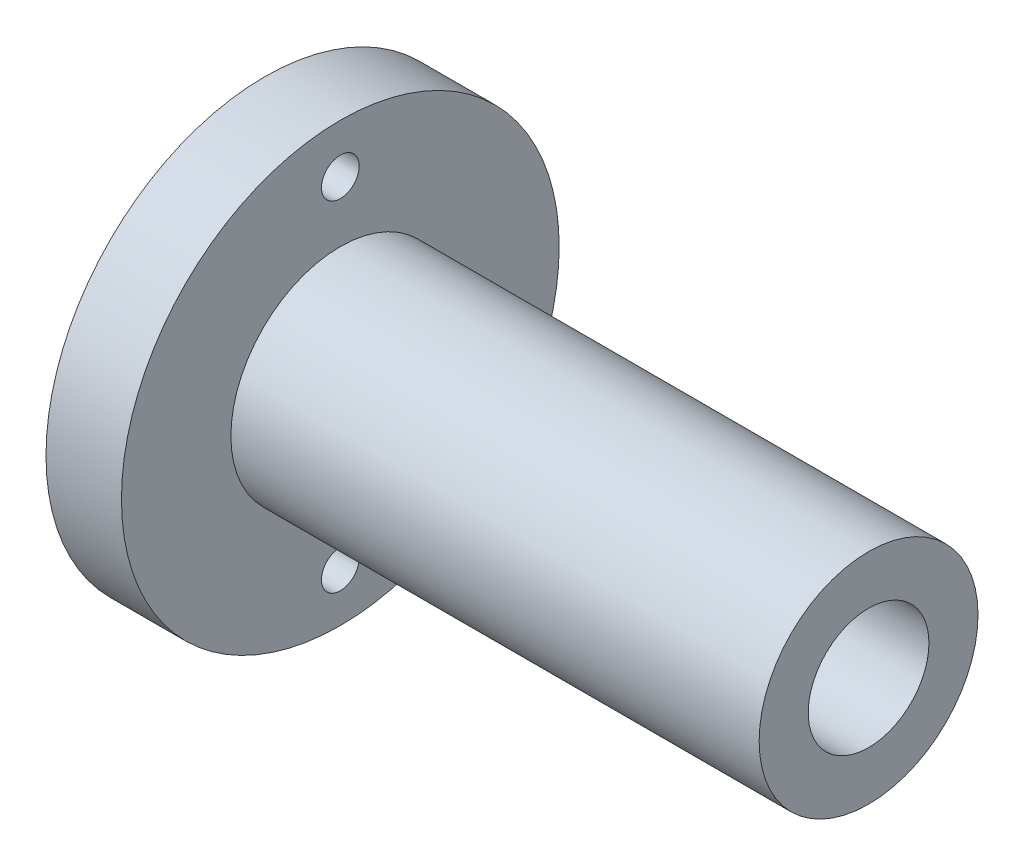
from build123d import *

# Parameters (mm, degrees)
SKETCH1_R           = 14.5
BOSS_EXTRUDE1_DEPTH = 70
SKETCH2_R           = 29
BOSS_EXTRUDE2_DEPTH = 10
SKETCH3_R           = 13
CUT_EXTRUDE1_DEPTH  = 48
CUT_EXTRUDE2_REACH  = 91.9
SKETCH4_R           = 8
CHAMFER1_SIZE       = 4
CUT_EXTRUDE3_REACH  = 91.9
SKETCH5_R           = 2.5


with BuildPart() as part:
    # Sketch1 → Boss-Extrude1 (new body)
    with BuildSketch(Plane(origin=(0, 0, 0), x_dir=(0, 0, -1), z_dir=(1, 0, 0))):
        Circle(SKETCH1_R)
    extrude(amount=BOSS_EXTRUDE1_DEPTH)

    # Sketch2 → Boss-Extrude2 (add)
    with BuildSketch(Plane.ZY):
        Circle(SKETCH2_R)
    extrude(amount=BOSS_EXTRUDE2_DEPTH)

    # Sketch3 → Cut-Extrude1 (cut)
    with BuildSketch(Plane.ZY.offset(10)):
        Circle(SKETCH3_R)
    extrude(amount=-CUT_EXTRUDE1_DEPTH, mode=Mode.SUBTRACT)

    # Sketch4 → Cut-Extrude2 (cut, up to next)
    with BuildSketch(Plane(origin=(70, 0, 0), x_dir=(0, 0, -1), z_dir=(1, 0, 0)), mode=Mode.PRIVATE) as cut_extrude2_sk1:
        Circle(SKETCH4_R)
    cut_extrude2_tool1 = extrude(cut_extrude2_sk1.sketch, amount=-CUT_EXTRUDE2_REACH, mode=Mode.PRIVATE) & part.part
    add(cut_extrude2_tool1.solids().sort_by_distance((70, 0, 0))[0], mode=Mode.SUBTRACT)

    # Chamfer1
    chamfer1_edges = [part.edges().sort_by_distance(p)[0] for p in [
        (-10, 0, -13),
    ]]
    chamfer(chamfer1_edges, length=CHAMFER1_SIZE)

    # Sketch5 → Cut-Extrude3 (cut, up to next)
    with BuildSketch(Plane.ZY.offset(10), mode=Mode.PRIVATE) as cut_extrude3_sk1:
        with Locations((0, 22.5)):
            Circle(SKETCH5_R)
    cut_extrude3_tool1 = extrude(cut_extrude3_sk1.sketch, amount=-CUT_EXTRUDE3_REACH, mode=Mode.PRIVATE) & part.part
    # Sketch5 → Cut-Extrude3 (cut, up to next)
    with BuildSketch(Plane.ZY.offset(10), mode=Mode.PRIVATE) as cut_extrude3_sk2:
        with Locations((0, -22.5)):
            Circle(SKETCH5_R)
    cut_extrude3_tool2 = extrude(cut_extrude3_sk2.sketch, amount=-CUT_EXTRUDE3_REACH, mode=Mode.PRIVATE) & part.part
    add(cut_extrude3_tool1.solids().sort_by_distance((-10, 22.5, 0))[0], mode=Mode.SUBTRACT)
    add(cut_extrude3_tool2.solids().sort_by_distance((-10, -22.5, 0))[0], mode=Mode.SUBTRACT)


solid = part.part
